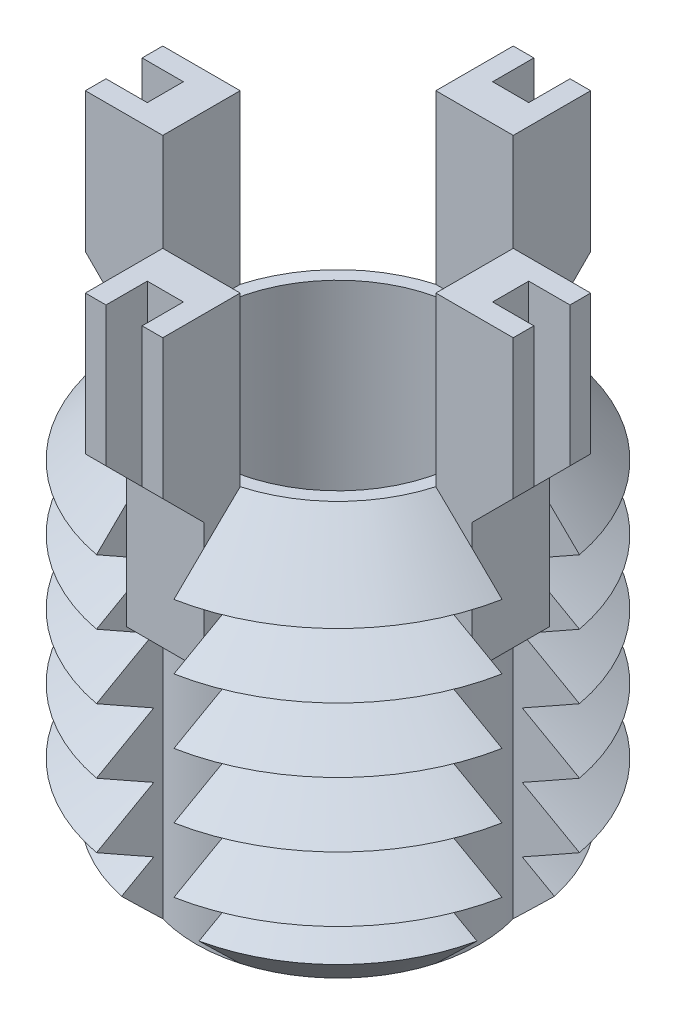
from build123d import *

# Parameters (mm, degrees)
SKETCH1_R               = 4
BOSS_EXTRUDE1_DEPTH     = 8
CHAMFER1_SIZE           = 1.25
LPATTERN1_COUNT         = 5
LPATTERN1_PITCH         = 1.25
CUT_EXTRUDE1_REACH      = 11.798
CIRPATTERN1_COUNT       = 4
BOSS_EXTRUDE3_DEPTH     = 0.75
CIRPATTERN2_COUNT       = 4
CUT_EXTRUDE3_DEPTH      = 13.68609506
CUT_EXTRUDE3_DEPTH_BACK = 13.68609506
SKETCH6_W               = 0.8
SKETCH6_H               = 0.7
SKETCH6_W_2             = 0.7
SKETCH6_H_2             = 0.8
SKETCH7_R               = 2.5
CUT_EXTRUDE4_DEPTH      = 8


with BuildPart() as part:
    # Sketch1 → Boss-Extrude1 (new body)
    with BuildSketch(Plane(origin=(0, 0, 0), x_dir=(1, 0, 0), z_dir=(0, 1, 0))):
        with Locations(Location((0, 0, 0), (0, 0, 270))):
            Circle(SKETCH1_R)
    extrude(amount=-BOSS_EXTRUDE1_DEPTH)

    # Chamfer1
    chamfer1_edges = [part.edges().sort_by_distance(p)[0] for p in [
        (0, 0, -4),
        (0, -8, -4),
    ]]
    chamfer(chamfer1_edges, length=CHAMFER1_SIZE)

    # Sketch3 → Cut-Revolve1 (revolve, cut)
    with BuildSketch(Plane(origin=(0, 0, 0), x_dir=(0, 0, -1), z_dir=(1, 0, 0))):
        Polygon((-4, -1.25), (-2.917468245, -1.875), (-4, -2.5), align=None)
    cut_revolve1 = revolve(axis=Axis((0, 0.885892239, 0), (0, -1, 0)), mode=Mode.SUBTRACT)

    # LPattern1: Cut-Revolve1 ×5
    with Locations(*[(0, -i * LPATTERN1_PITCH, 0) for i in range(1, LPATTERN1_COUNT)]):
        add(cut_revolve1, mode=Mode.SUBTRACT)

    # Cut-Extrude1: up to this cone (the profile starts inside it)
    cut_extrude1_end = Plane(origin=(0, 0, 0), z_dir=(0, 1, 0)).offset(-10.749999) * Cone(1e-06, 33.798, 33.797999, align=(Align.CENTER, Align.CENTER, Align.MIN), mode=Mode.PRIVATE)
    # Sketch4 → Cut-Extrude1 (cut, up to the surface)
    with BuildSketch(Plane(origin=(0, 0, 0), x_dir=(1, 0, 0), z_dir=(0, 1, 0)), mode=Mode.PRIVATE) as cut_extrude1_sk1:
        with BuildLine():
            Line((-2.645751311, 0.75), (-3.929058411, 0.75))
            ThreePointArc((-3.929058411, 0.75), (-4, 0), (-3.929058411, -0.75))
            Line((-3.929058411, -0.75), (-2.645751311, -0.75))
            ThreePointArc((-2.645751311, -0.75), (-2.75, 0), (-2.645751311, 0.75))
        make_face()
    cut_extrude1_tool1 = extrude(cut_extrude1_sk1.sketch, amount=-CUT_EXTRUDE1_REACH, mode=Mode.PRIVATE) & cut_extrude1_end
    cut_extrude1 = cut_extrude1_tool1.solids().sort_by_distance((-3.345774, 0, 0))[0]
    add(cut_extrude1, mode=Mode.SUBTRACT)

    # CirPattern1: Cut-Extrude1 ×4 about axis
    cirpattern1_axis = Axis((0, 0, 0), (0, 1, 0))
    for i in range(1, CIRPATTERN1_COUNT):
        add(cut_extrude1.rotate(cirpattern1_axis, i * 360 / CIRPATTERN1_COUNT), mode=Mode.SUBTRACT)

    # Sketch5 → Boss-Extrude3 (add, symmetric)
    with BuildSketch(Plane(origin=(0, 0, 0), x_dir=(0, 0, -1), z_dir=(1, 0, 0))):
        Polygon((-2.645751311, 3.25), (-2.645751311, -2.75), (-3.345751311, -2.75), (-3.345751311, -0.25), (-4.145751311, 0.55), (-4.145751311, 3.25), align=None)
    boss_extrude3 = extrude(amount=BOSS_EXTRUDE3_DEPTH, both=True)

    # CirPattern2: Boss-Extrude3 ×4 about axis
    cirpattern2_axis = Axis((0, 0, 0), (0, 1, 0))
    for i in range(1, CIRPATTERN2_COUNT):
        add(boss_extrude3.rotate(cirpattern2_axis, i * 360 / CIRPATTERN2_COUNT))

    # Sketch6 → Cut-Extrude3 (cut, two sides: drawn at the far end of the back side and taken through both)
    with BuildSketch(Plane(origin=(0, 3.25, 0), x_dir=(1, 0, 0), z_dir=(0, 1, 0)).offset(-CUT_EXTRUDE3_DEPTH_BACK)):
        with Locations((-3.745751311, 0)):
            Rectangle(SKETCH6_W, SKETCH6_H)
        with Locations((0, 3.745751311)):
            Rectangle(SKETCH6_W_2, SKETCH6_H_2)
        with Locations((3.745751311, 0)):
            Rectangle(SKETCH6_W, SKETCH6_H)
        with Locations((0, -3.745751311)):
            Rectangle(SKETCH6_W_2, SKETCH6_H_2)
    extrude(amount=CUT_EXTRUDE3_DEPTH + CUT_EXTRUDE3_DEPTH_BACK, mode=Mode.SUBTRACT)

    # Sketch7 → Cut-Extrude4 (cut)
    with BuildSketch(Plane(origin=(0, 0, 0), x_dir=(1, 0, 0), z_dir=(0, 1, 0))):
        with Locations(Location((0, 0, 0), (0, 0, 270))):
            Circle(SKETCH7_R)
    extrude(amount=-CUT_EXTRUDE4_DEPTH, mode=Mode.SUBTRACT)


solid = part.part
